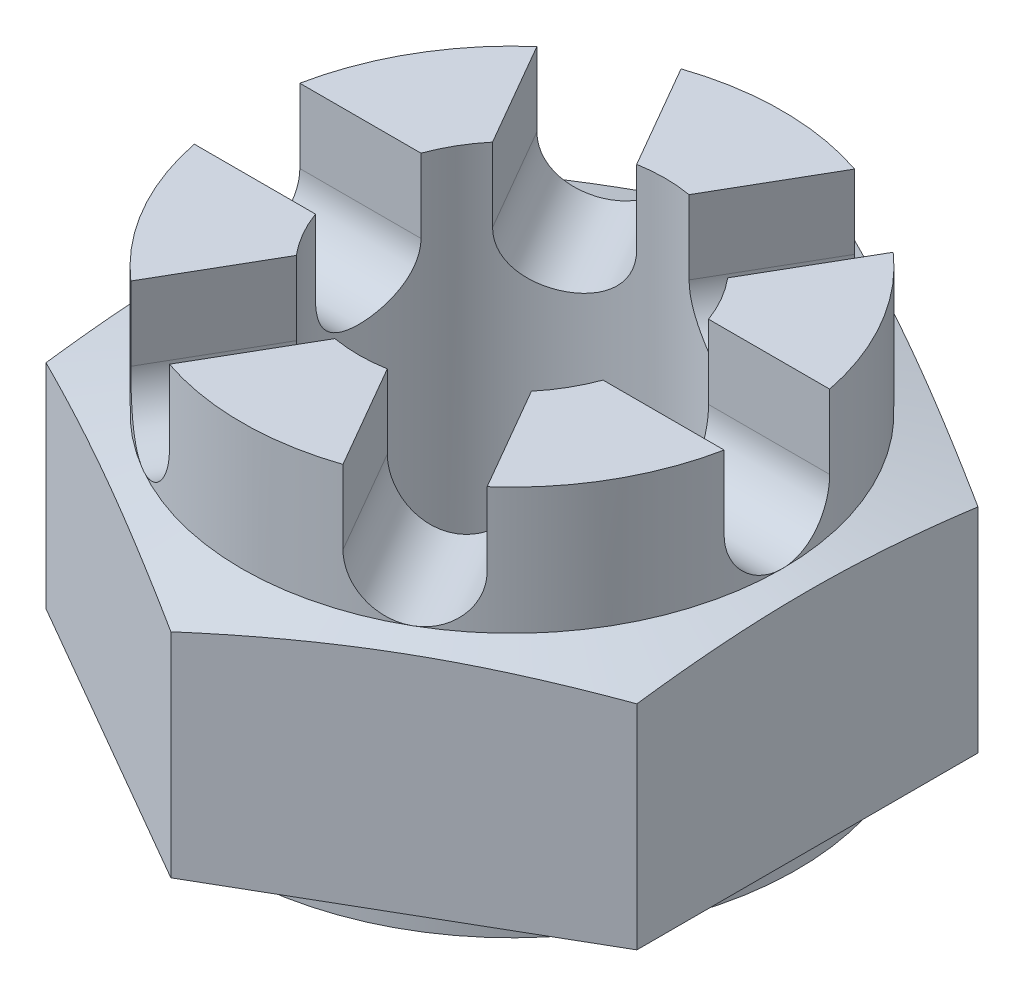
from build123d import *

# Parameters (mm, degrees)
SKETCH_1_R               = 2.88036
EXTRUDE_1_DEPTH          = 7.14375
SKETCH_2_W               = 1.057992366
SKETCH_2_H               = 0.396875
CUT_EXTRUDE_1_DEPTH      = 12.093585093
PATTERN_CIRCULAR_1_COUNT = 6


with BuildPart() as part:
    # Sketch 1 → Extrude 1 (new body)
    with BuildSketch(Plane(origin=(0, 0, 0), x_dir=(1, 0, 0), z_dir=(0, 1, 0))):
        Polygon((0, 6.415804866), (-5.55625, 3.207902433), (-5.55625, -3.207902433), (0, -6.415804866), (5.55625, -3.207902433), (5.55625, 3.207902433), align=None)
        with Locations(Location((0, 0, 0), (0, 0, 270))):
            Circle(SKETCH_1_R, mode=Mode.SUBTRACT)
    extrude(amount=EXTRUDE_1_DEPTH)

    # Sketch 2 → Cut-Revolve 1 (revolve, cut)
    with BuildSketch(Plane(origin=(0, 0, 0), x_dir=(0, 0, -1), z_dir=(1, 0, 0))):
        with Locations((5.886808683, 0.1984375)):
            Rectangle(SKETCH_2_W, SKETCH_2_H)
        Polygon((6.415804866, 7.14375), (5.08, 7.14375), (5.08, 4.7625), (6.415804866, 4.404572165), align=None)
    revolve(axis=Axis((0, 0, 0), (0, 1, 0)), mode=Mode.SUBTRACT)

    # Sketch 3 → Cut-Extrude 1 (cut, through all)
    with BuildSketch(Plane(origin=(0, 0, 0), x_dir=(0, 0, -1), z_dir=(1, 0, 0))):
        with BuildLine():
            Line((0.9921875, 7.14375), (-0.9921875, 7.14375))
            Line((-0.9921875, 7.14375), (-0.9921875, 5.7546875))
            ThreePointArc((-0.9921875, 5.7546875), (0, 4.7625), (0.9921875, 5.7546875))
            Line((0.9921875, 5.7546875), (0.9921875, 7.14375))
        make_face()
    cut_extrude_1 = extrude(amount=-CUT_EXTRUDE_1_DEPTH, mode=Mode.SUBTRACT)

    # Pattern Circular 1: Cut-Extrude 1 ×6 about axis
    pattern_circular_1_axis = Axis((0, 0, 0), (0, 1, 0))
    for i in range(1, PATTERN_CIRCULAR_1_COUNT):
        add(cut_extrude_1.rotate(pattern_circular_1_axis, i * 360 / PATTERN_CIRCULAR_1_COUNT), mode=Mode.SUBTRACT)


solid = part.part
